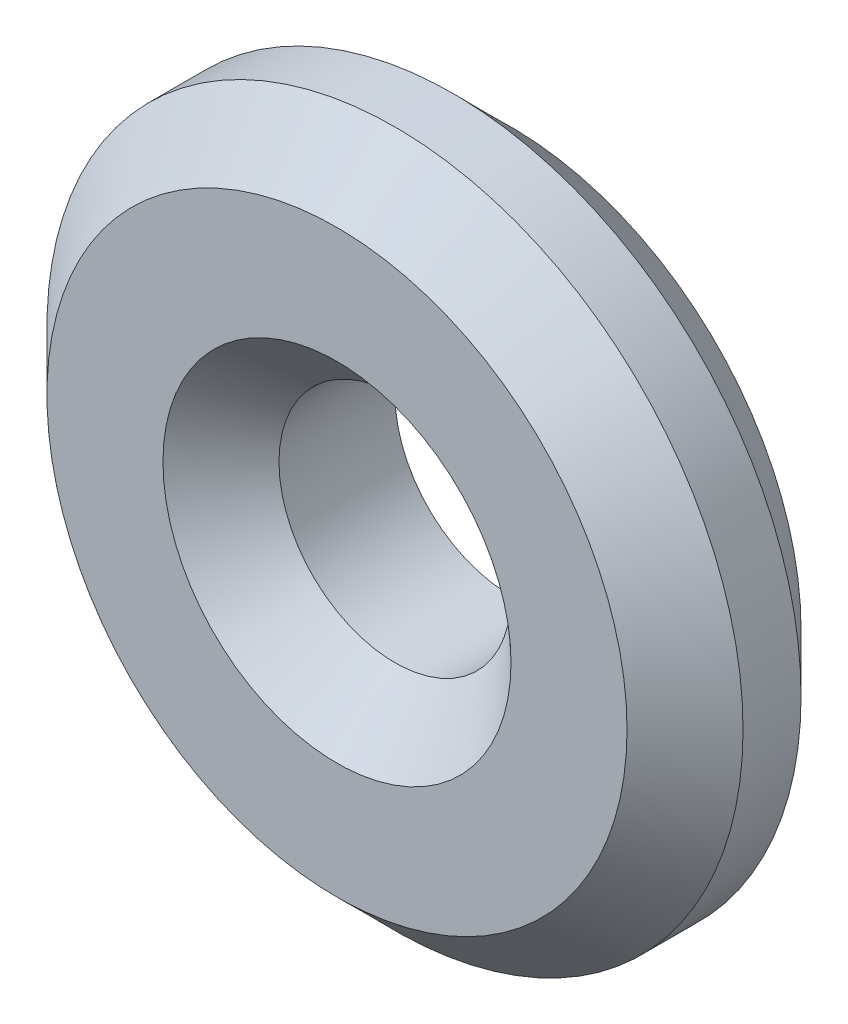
ISO-10303-21;
HEADER;
FILE_DESCRIPTION(('STEP AP214'),'2;1');
FILE_NAME('part.step','',(''),(''),'','','');
FILE_SCHEMA(('AUTOMOTIVE_DESIGN { 1 0 10303 214 1 1 1 1 }'));
ENDSEC;
DATA;
#1=APPLICATION_CONTEXT('core data for automotive mechanical design processes');
#2=APPLICATION_PROTOCOL_DEFINITION('international standard','automotive_design',2000,#1);
#3=PRODUCT_CONTEXT('',#1,'mechanical');
#4=PRODUCT('Part','Part','',(#3));
#5=PRODUCT_RELATED_PRODUCT_CATEGORY('part','',(#4));
#6=PRODUCT_DEFINITION_FORMATION('','',#4);
#7=PRODUCT_DEFINITION_CONTEXT('part definition',#1,'design');
#8=PRODUCT_DEFINITION('design','',#6,#7);
#9=PRODUCT_DEFINITION_SHAPE('','',#8);
#10=(LENGTH_UNIT() NAMED_UNIT(*) SI_UNIT(.MILLI.,.METRE.));
#11=(NAMED_UNIT(*) PLANE_ANGLE_UNIT() SI_UNIT($,.RADIAN.));
#12=(NAMED_UNIT(*) SI_UNIT($,.STERADIAN.) SOLID_ANGLE_UNIT());
#13=UNCERTAINTY_MEASURE_WITH_UNIT(LENGTH_MEASURE(1.E-05),#10,'distance_accuracy_value','');
#14=(GEOMETRIC_REPRESENTATION_CONTEXT(3) GLOBAL_UNCERTAINTY_ASSIGNED_CONTEXT((#13)) GLOBAL_UNIT_ASSIGNED_CONTEXT((#10,
#11,#12)) REPRESENTATION_CONTEXT('',''));
#15=CARTESIAN_POINT('',(0.,0.,0.));
#16=DIRECTION('',(0.,0.,1.));
#17=DIRECTION('',(1.,0.,0.));
#18=AXIS2_PLACEMENT_3D('',#15,#16,#17);
#19=CARTESIAN_POINT('',(0.,0.,-3.));
#20=DIRECTION('',(0.,0.,1.));
#21=DIRECTION('',(1.,0.,0.));
#22=AXIS2_PLACEMENT_3D('',#19,#20,#21);
#23=CYLINDRICAL_SURFACE('',#22,6.);
#24=CARTESIAN_POINT('',(0.,0.,-1.00000000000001));
#25=DIRECTION('',(0.,0.,1.));
#26=DIRECTION('',(1.,0.,0.));
#27=AXIS2_PLACEMENT_3D('',#24,#25,#26);
#28=CIRCLE('',#27,6.);
#29=CARTESIAN_POINT('',(6.,0.,-1.00000000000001));
#30=VERTEX_POINT('',#29);
#31=EDGE_CURVE('E41',#30,#30,#28,.F.);
#32=ORIENTED_EDGE('',*,*,#31,.T.);
#33=EDGE_LOOP('',(#32));
#34=FACE_BOUND('',#33,.T.);
#35=CARTESIAN_POINT('',(0.,0.,-1.99999999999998));
#36=DIRECTION('',(0.,0.,1.));
#37=DIRECTION('',(1.,0.,0.));
#38=AXIS2_PLACEMENT_3D('',#35,#36,#37);
#39=CIRCLE('',#38,6.);
#40=CARTESIAN_POINT('',(6.,0.,-1.99999999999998));
#41=VERTEX_POINT('',#40);
#42=EDGE_CURVE('E46',#41,#41,#39,.T.);
#43=ORIENTED_EDGE('',*,*,#42,.T.);
#44=EDGE_LOOP('',(#43));
#45=FACE_BOUND('',#44,.T.);
#46=ADVANCED_FACE('F27',(#34,#45),#23,.T.);
#47=CARTESIAN_POINT('',(0.,0.,-3.));
#48=DIRECTION('',(0.,0.,1.));
#49=DIRECTION('',(1.,0.,0.));
#50=AXIS2_PLACEMENT_3D('',#47,#48,#49);
#51=PLANE('',#50);
#52=CARTESIAN_POINT('',(0.,0.,-3.));
#53=DIRECTION('',(0.,0.,1.));
#54=DIRECTION('',(1.,0.,0.));
#55=AXIS2_PLACEMENT_3D('',#52,#53,#54);
#56=CIRCLE('',#55,2.);
#57=CARTESIAN_POINT('',(2.,0.,-3.));
#58=VERTEX_POINT('',#57);
#59=EDGE_CURVE('E52',#58,#58,#56,.T.);
#60=ORIENTED_EDGE('',*,*,#59,.T.);
#61=EDGE_LOOP('',(#60));
#62=FACE_BOUND('',#61,.T.);
#63=CARTESIAN_POINT('',(0.,0.,-3.));
#64=DIRECTION('',(0.,0.,1.));
#65=DIRECTION('',(1.,0.,0.));
#66=AXIS2_PLACEMENT_3D('',#63,#64,#65);
#67=CIRCLE('',#66,4.99999999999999);
#68=CARTESIAN_POINT('',(4.99999999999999,0.,-3.));
#69=VERTEX_POINT('',#68);
#70=EDGE_CURVE('E37',#69,#69,#67,.F.);
#71=ORIENTED_EDGE('',*,*,#70,.T.);
#72=EDGE_LOOP('',(#71));
#73=FACE_BOUND('',#72,.T.);
#74=ADVANCED_FACE('F56',(#62,#73),#51,.F.);
#75=CARTESIAN_POINT('',(0.,0.,0.));
#76=DIRECTION('',(0.,0.,1.));
#77=DIRECTION('',(1.,0.,0.));
#78=AXIS2_PLACEMENT_3D('',#75,#76,#77);
#79=PLANE('',#78);
#80=CARTESIAN_POINT('',(0.,0.,0.));
#81=DIRECTION('',(0.,0.,1.));
#82=DIRECTION('',(1.,0.,0.));
#83=AXIS2_PLACEMENT_3D('',#80,#81,#82);
#84=CIRCLE('',#83,3.00000000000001);
#85=CARTESIAN_POINT('',(3.00000000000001,0.,0.));
#86=VERTEX_POINT('',#85);
#87=EDGE_CURVE('E10',#86,#86,#84,.F.);
#88=ORIENTED_EDGE('',*,*,#87,.T.);
#89=EDGE_LOOP('',(#88));
#90=FACE_BOUND('',#89,.T.);
#91=CARTESIAN_POINT('',(0.,0.,0.));
#92=DIRECTION('',(0.,0.,1.));
#93=DIRECTION('',(1.,0.,0.));
#94=AXIS2_PLACEMENT_3D('',#91,#92,#93);
#95=CIRCLE('',#94,4.99999999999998);
#96=CARTESIAN_POINT('',(4.99999999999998,0.,0.));
#97=VERTEX_POINT('',#96);
#98=EDGE_CURVE('E49',#97,#97,#95,.T.);
#99=ORIENTED_EDGE('',*,*,#98,.T.);
#100=EDGE_LOOP('',(#99));
#101=FACE_BOUND('',#100,.T.);
#102=ADVANCED_FACE('F78',(#90,#101),#79,.T.);
#103=CARTESIAN_POINT('',(0.,0.,0.));
#104=DIRECTION('',(0.,0.,-1.));
#105=DIRECTION('',(-1.,0.,0.));
#106=AXIS2_PLACEMENT_3D('',#103,#104,#105);
#107=CONICAL_SURFACE('',#106,4.99999999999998,0.785398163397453);
#108=ORIENTED_EDGE('',*,*,#31,.F.);
#109=EDGE_LOOP('',(#108));
#110=FACE_BOUND('',#109,.T.);
#111=ORIENTED_EDGE('',*,*,#98,.F.);
#112=EDGE_LOOP('',(#111));
#113=FACE_BOUND('',#112,.T.);
#114=ADVANCED_FACE('F70',(#110,#113),#107,.T.);
#115=CARTESIAN_POINT('',(0.,0.,-1.99999999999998));
#116=DIRECTION('',(0.,0.,1.));
#117=DIRECTION('',(1.,0.,0.));
#118=AXIS2_PLACEMENT_3D('',#115,#116,#117);
#119=CONICAL_SURFACE('',#118,6.,0.785398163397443);
#120=ORIENTED_EDGE('',*,*,#70,.F.);
#121=EDGE_LOOP('',(#120));
#122=FACE_BOUND('',#121,.T.);
#123=ORIENTED_EDGE('',*,*,#42,.F.);
#124=EDGE_LOOP('',(#123));
#125=FACE_BOUND('',#124,.T.);
#126=ADVANCED_FACE('F62',(#122,#125),#119,.T.);
#127=CARTESIAN_POINT('',(0.,0.,-3.));
#128=DIRECTION('',(0.,0.,1.));
#129=DIRECTION('',(1.,0.,0.));
#130=AXIS2_PLACEMENT_3D('',#127,#128,#129);
#131=CYLINDRICAL_SURFACE('',#130,2.);
#132=CARTESIAN_POINT('',(0.,0.,-1.00000000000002));
#133=DIRECTION('',(0.,0.,1.));
#134=DIRECTION('',(1.,0.,0.));
#135=AXIS2_PLACEMENT_3D('',#132,#133,#134);
#136=CIRCLE('',#135,2.);
#137=CARTESIAN_POINT('',(2.,0.,-1.00000000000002));
#138=VERTEX_POINT('',#137);
#139=EDGE_CURVE('E33',#138,#138,#136,.T.);
#140=ORIENTED_EDGE('',*,*,#139,.T.);
#141=EDGE_LOOP('',(#140));
#142=FACE_BOUND('',#141,.T.);
#143=ORIENTED_EDGE('',*,*,#59,.F.);
#144=EDGE_LOOP('',(#143));
#145=FACE_BOUND('',#144,.T.);
#146=ADVANCED_FACE('F59',(#142,#145),#131,.F.);
#147=CARTESIAN_POINT('',(0.,0.,-1.00000000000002));
#148=DIRECTION('',(0.,0.,1.));
#149=DIRECTION('',(1.,0.,0.));
#150=AXIS2_PLACEMENT_3D('',#147,#148,#149);
#151=CONICAL_SURFACE('',#150,2.,0.785398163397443);
#152=ORIENTED_EDGE('',*,*,#87,.F.);
#153=EDGE_LOOP('',(#152));
#154=FACE_BOUND('',#153,.T.);
#155=ORIENTED_EDGE('',*,*,#139,.F.);
#156=EDGE_LOOP('',(#155));
#157=FACE_BOUND('',#156,.T.);
#158=ADVANCED_FACE('F61',(#154,#157),#151,.F.);
#159=CLOSED_SHELL('',(#46,#74,#102,#114,#126,#146,#158));
#160=MANIFOLD_SOLID_BREP('B2',#159);
#161=ADVANCED_BREP_SHAPE_REPRESENTATION('',(#18,#160),#14);
#162=SHAPE_DEFINITION_REPRESENTATION(#9,#161);
ENDSEC;
END-ISO-10303-21;
